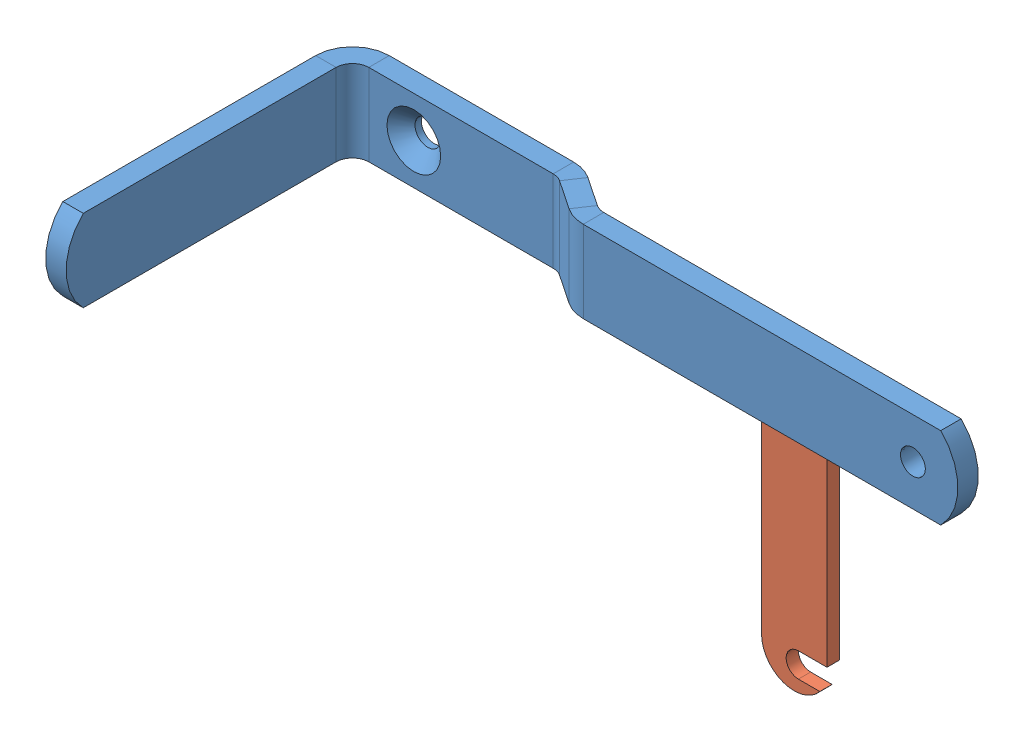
SolidWorks assembly Patin de frein gauche.SLDASM, configuration Défaut (file format 7000). Lengths in mm.
Overall size (160 75 75).
2 component instances, 2 part files, 3 mates.
Components (placement in the parent):
- Patin de frein-1: Patin de frein.SLDPRT [Défaut] at origin size (160 20 75)
- Attache ressort de frein-1: Attache ressort de frein.SLDPRT [Défaut] at (113 -10 -65) x (1 0 0) z (0 0 -1) size (16 55 3)
Mates (geometry in assembly coordinates):
- Coïncidente2: coincident aligned: plane of Patin de frein-1 through (-1.9055 0 -68) normal (0 0 -1); plane of Attache ressort de frein-1 through (114 -59 -68) normal (0 0 -1)
- Distance1: distance = 110 mm aligned: plane of Attache ressort de frein-1 through (105 -57 -68) normal (-1 0 0); plane of Patin de frein-1 through (-5 0 0) normal (-1 0 0)
- Coïncidente3: coincident anti-aligned: plane of Patin de frein-1 through (-1.9055 -10 -68) normal (0 -1 0); plane of Attache ressort de frein-1 through (105 -10 -68) normal (0 1 0)
